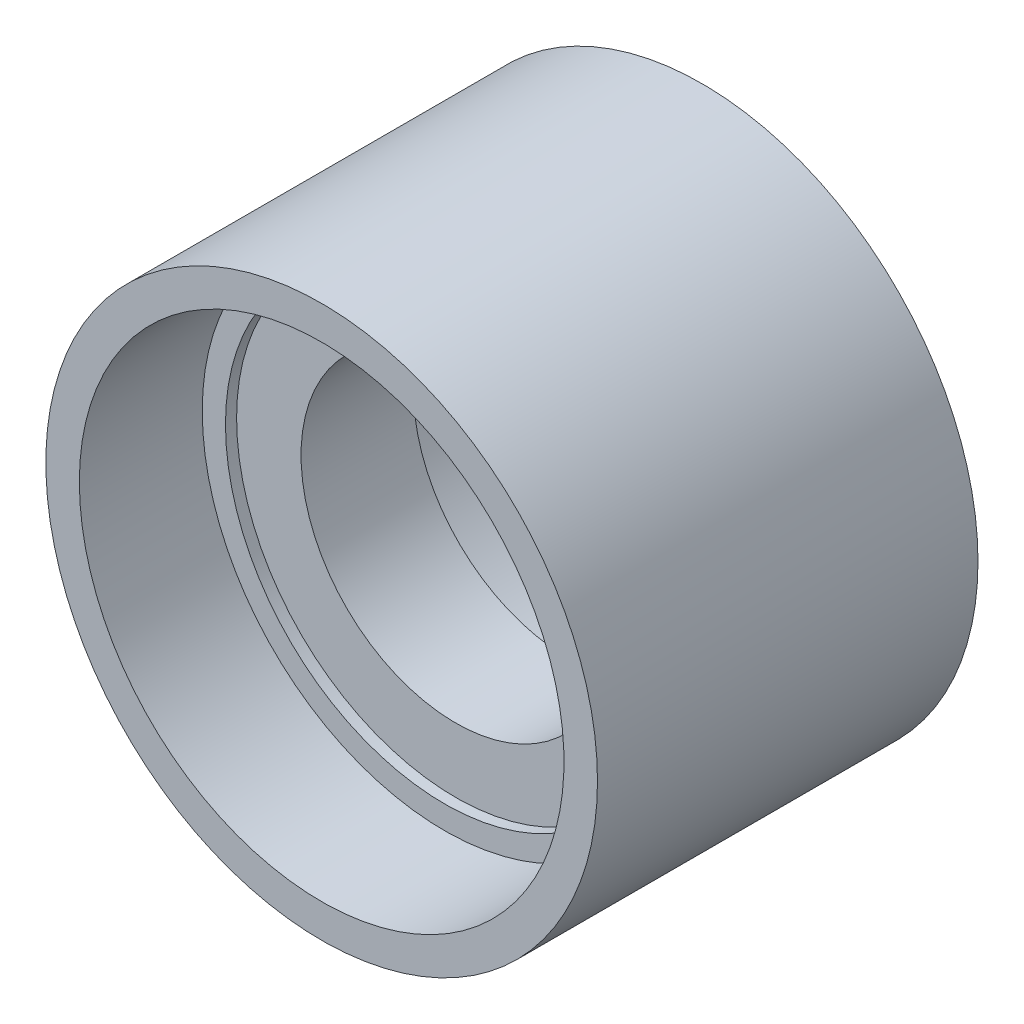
ISO-10303-21;
HEADER;
FILE_DESCRIPTION(('STEP AP214'),'2;1');
FILE_NAME('part.step','',(''),(''),'','','');
FILE_SCHEMA(('AUTOMOTIVE_DESIGN { 1 0 10303 214 1 1 1 1 }'));
ENDSEC;
DATA;
#1=APPLICATION_CONTEXT('core data for automotive mechanical design processes');
#2=APPLICATION_PROTOCOL_DEFINITION('international standard','automotive_design',2000,#1);
#3=PRODUCT_CONTEXT('',#1,'mechanical');
#4=PRODUCT('Part','Part','',(#3));
#5=PRODUCT_RELATED_PRODUCT_CATEGORY('part','',(#4));
#6=PRODUCT_DEFINITION_FORMATION('','',#4);
#7=PRODUCT_DEFINITION_CONTEXT('part definition',#1,'design');
#8=PRODUCT_DEFINITION('design','',#6,#7);
#9=PRODUCT_DEFINITION_SHAPE('','',#8);
#10=(LENGTH_UNIT() NAMED_UNIT(*) SI_UNIT(.MILLI.,.METRE.));
#11=(NAMED_UNIT(*) PLANE_ANGLE_UNIT() SI_UNIT($,.RADIAN.));
#12=(NAMED_UNIT(*) SI_UNIT($,.STERADIAN.) SOLID_ANGLE_UNIT());
#13=UNCERTAINTY_MEASURE_WITH_UNIT(LENGTH_MEASURE(1.E-05),#10,'distance_accuracy_value','');
#14=(GEOMETRIC_REPRESENTATION_CONTEXT(3) GLOBAL_UNCERTAINTY_ASSIGNED_CONTEXT((#13)) GLOBAL_UNIT_ASSIGNED_CONTEXT((#10,
#11,#12)) REPRESENTATION_CONTEXT('',''));
#15=CARTESIAN_POINT('',(0.,0.,0.));
#16=DIRECTION('',(0.,0.,1.));
#17=DIRECTION('',(1.,0.,0.));
#18=AXIS2_PLACEMENT_3D('',#15,#16,#17);
#19=CARTESIAN_POINT('',(0.,0.,0.));
#20=DIRECTION('',(0.,0.,1.));
#21=DIRECTION('',(1.,0.,0.));
#22=AXIS2_PLACEMENT_3D('',#19,#20,#21);
#23=CYLINDRICAL_SURFACE('',#22,15.);
#24=CARTESIAN_POINT('',(0.,0.,5.45));
#25=DIRECTION('',(0.,0.,1.));
#26=DIRECTION('',(1.,0.,0.));
#27=AXIS2_PLACEMENT_3D('',#24,#25,#26);
#28=CIRCLE('',#27,15.);
#29=CARTESIAN_POINT('',(15.,0.,5.45));
#30=VERTEX_POINT('',#29);
#31=EDGE_CURVE('E52',#30,#30,#28,.T.);
#32=ORIENTED_EDGE('',*,*,#31,.T.);
#33=EDGE_LOOP('',(#32));
#34=FACE_BOUND('',#33,.T.);
#35=CARTESIAN_POINT('',(0.,0.,-5.45));
#36=DIRECTION('',(0.,0.,1.));
#37=DIRECTION('',(1.,0.,0.));
#38=AXIS2_PLACEMENT_3D('',#35,#36,#37);
#39=CIRCLE('',#38,15.);
#40=CARTESIAN_POINT('',(15.,0.,-5.45));
#41=VERTEX_POINT('',#40);
#42=EDGE_CURVE('E18',#41,#41,#39,.F.);
#43=ORIENTED_EDGE('',*,*,#42,.T.);
#44=EDGE_LOOP('',(#43));
#45=FACE_BOUND('',#44,.T.);
#46=ADVANCED_FACE('F14',(#34,#45),#23,.F.);
#47=CARTESIAN_POINT('',(21.675,21.675,-5.45));
#48=DIRECTION('',(0.,0.,1.));
#49=DIRECTION('',(-1.,0.,0.));
#50=AXIS2_PLACEMENT_3D('',#47,#48,#49);
#51=PLANE('',#50);
#52=ORIENTED_EDGE('',*,*,#42,.F.);
#53=EDGE_LOOP('',(#52));
#54=FACE_BOUND('',#53,.T.);
#55=CARTESIAN_POINT('',(0.,0.,-5.45));
#56=DIRECTION('',(0.,0.,1.));
#57=DIRECTION('',(0.,-1.,0.));
#58=AXIS2_PLACEMENT_3D('',#55,#56,#57);
#59=CIRCLE('',#58,21.25);
#60=CARTESIAN_POINT('',(0.,-21.25,-5.45));
#61=VERTEX_POINT('',#60);
#62=EDGE_CURVE('E50',#61,#61,#59,.F.);
#63=ORIENTED_EDGE('',*,*,#62,.T.);
#64=EDGE_LOOP('',(#63));
#65=FACE_BOUND('',#64,.T.);
#66=ADVANCED_FACE('F60',(#54,#65),#51,.F.);
#67=CARTESIAN_POINT('',(0.,0.,5.45));
#68=DIRECTION('',(0.,0.,-1.));
#69=DIRECTION('',(-1.,0.,0.));
#70=AXIS2_PLACEMENT_3D('',#67,#68,#69);
#71=PLANE('',#70);
#72=ORIENTED_EDGE('',*,*,#31,.F.);
#73=EDGE_LOOP('',(#72));
#74=FACE_BOUND('',#73,.T.);
#75=CARTESIAN_POINT('',(0.,0.,5.45));
#76=DIRECTION('',(0.,0.,-1.));
#77=DIRECTION('',(-1.,0.,0.));
#78=AXIS2_PLACEMENT_3D('',#75,#76,#77);
#79=CIRCLE('',#78,21.25);
#80=CARTESIAN_POINT('',(-21.25,0.,5.45));
#81=VERTEX_POINT('',#80);
#82=EDGE_CURVE('E47',#81,#81,#79,.F.);
#83=ORIENTED_EDGE('',*,*,#82,.T.);
#84=EDGE_LOOP('',(#83));
#85=FACE_BOUND('',#84,.T.);
#86=ADVANCED_FACE('F63',(#74,#85),#71,.F.);
#87=CARTESIAN_POINT('',(0.,0.,-6.53));
#88=DIRECTION('',(0.,0.,1.));
#89=DIRECTION('',(0.,-1.,0.));
#90=AXIS2_PLACEMENT_3D('',#87,#88,#89);
#91=CYLINDRICAL_SURFACE('',#90,21.25);
#92=CARTESIAN_POINT('',(0.,0.,-6.53));
#93=DIRECTION('',(0.,0.,1.));
#94=DIRECTION('',(0.,-1.,0.));
#95=AXIS2_PLACEMENT_3D('',#92,#93,#94);
#96=CIRCLE('',#95,21.25);
#97=CARTESIAN_POINT('',(0.,-21.25,-6.53));
#98=VERTEX_POINT('',#97);
#99=EDGE_CURVE('E44',#98,#98,#96,.F.);
#100=ORIENTED_EDGE('',*,*,#99,.T.);
#101=EDGE_LOOP('',(#100));
#102=FACE_BOUND('',#101,.T.);
#103=ORIENTED_EDGE('',*,*,#62,.F.);
#104=EDGE_LOOP('',(#103));
#105=FACE_BOUND('',#104,.T.);
#106=ADVANCED_FACE('F67',(#102,#105),#91,.F.);
#107=CARTESIAN_POINT('',(0.,0.,18.45));
#108=DIRECTION('',(0.,0.,-1.));
#109=DIRECTION('',(-1.,0.,0.));
#110=AXIS2_PLACEMENT_3D('',#107,#108,#109);
#111=CYLINDRICAL_SURFACE('',#110,21.25);
#112=ORIENTED_EDGE('',*,*,#82,.F.);
#113=EDGE_LOOP('',(#112));
#114=FACE_BOUND('',#113,.T.);
#115=CARTESIAN_POINT('',(0.,0.,6.53));
#116=DIRECTION('',(0.,0.,-1.));
#117=DIRECTION('',(-1.,0.,0.));
#118=AXIS2_PLACEMENT_3D('',#115,#116,#117);
#119=CIRCLE('',#118,21.25);
#120=CARTESIAN_POINT('',(-21.25,0.,6.53));
#121=VERTEX_POINT('',#120);
#122=EDGE_CURVE('E41',#121,#121,#119,.F.);
#123=ORIENTED_EDGE('',*,*,#122,.T.);
#124=EDGE_LOOP('',(#123));
#125=FACE_BOUND('',#124,.T.);
#126=ADVANCED_FACE('F69',(#114,#125),#111,.F.);
#127=CARTESIAN_POINT('',(23.97,23.97,-6.53));
#128=DIRECTION('',(0.,0.,1.));
#129=DIRECTION('',(-1.,0.,0.));
#130=AXIS2_PLACEMENT_3D('',#127,#128,#129);
#131=PLANE('',#130);
#132=ORIENTED_EDGE('',*,*,#99,.F.);
#133=EDGE_LOOP('',(#132));
#134=FACE_BOUND('',#133,.T.);
#135=CARTESIAN_POINT('',(0.,0.,-6.53));
#136=DIRECTION('',(0.,0.,1.));
#137=DIRECTION('',(0.,-1.,0.));
#138=AXIS2_PLACEMENT_3D('',#135,#136,#137);
#139=CIRCLE('',#138,23.5);
#140=CARTESIAN_POINT('',(0.,-23.5,-6.53));
#141=VERTEX_POINT('',#140);
#142=EDGE_CURVE('E38',#141,#141,#139,.F.);
#143=ORIENTED_EDGE('',*,*,#142,.T.);
#144=EDGE_LOOP('',(#143));
#145=FACE_BOUND('',#144,.T.);
#146=ADVANCED_FACE('F77',(#134,#145),#131,.F.);
#147=CARTESIAN_POINT('',(0.,0.,6.53));
#148=DIRECTION('',(0.,0.,-1.));
#149=DIRECTION('',(-1.,0.,0.));
#150=AXIS2_PLACEMENT_3D('',#147,#148,#149);
#151=PLANE('',#150);
#152=ORIENTED_EDGE('',*,*,#122,.F.);
#153=EDGE_LOOP('',(#152));
#154=FACE_BOUND('',#153,.T.);
#155=CARTESIAN_POINT('',(0.,0.,6.53));
#156=DIRECTION('',(0.,0.,-1.));
#157=DIRECTION('',(-1.,0.,0.));
#158=AXIS2_PLACEMENT_3D('',#155,#156,#157);
#159=CIRCLE('',#158,23.5);
#160=CARTESIAN_POINT('',(-23.5,0.,6.53));
#161=VERTEX_POINT('',#160);
#162=EDGE_CURVE('E35',#161,#161,#159,.F.);
#163=ORIENTED_EDGE('',*,*,#162,.T.);
#164=EDGE_LOOP('',(#163));
#165=FACE_BOUND('',#164,.T.);
#166=ADVANCED_FACE('F101',(#154,#165),#151,.F.);
#167=CARTESIAN_POINT('',(0.,0.,-18.45));
#168=DIRECTION('',(0.,0.,1.));
#169=DIRECTION('',(0.,-1.,0.));
#170=AXIS2_PLACEMENT_3D('',#167,#168,#169);
#171=CYLINDRICAL_SURFACE('',#170,23.5);
#172=CARTESIAN_POINT('',(0.,0.,-18.45));
#173=DIRECTION('',(0.,0.,1.));
#174=DIRECTION('',(0.,-1.,0.));
#175=AXIS2_PLACEMENT_3D('',#172,#173,#174);
#176=CIRCLE('',#175,23.5);
#177=CARTESIAN_POINT('',(0.,-23.5,-18.45));
#178=VERTEX_POINT('',#177);
#179=EDGE_CURVE('E32',#178,#178,#176,.T.);
#180=ORIENTED_EDGE('',*,*,#179,.F.);
#181=EDGE_LOOP('',(#180));
#182=FACE_BOUND('',#181,.T.);
#183=ORIENTED_EDGE('',*,*,#142,.F.);
#184=EDGE_LOOP('',(#183));
#185=FACE_BOUND('',#184,.T.);
#186=ADVANCED_FACE('F16',(#182,#185),#171,.F.);
#187=CARTESIAN_POINT('',(0.,0.,18.45));
#188=DIRECTION('',(0.,0.,-1.));
#189=DIRECTION('',(-1.,0.,0.));
#190=AXIS2_PLACEMENT_3D('',#187,#188,#189);
#191=CYLINDRICAL_SURFACE('',#190,23.5);
#192=CARTESIAN_POINT('',(0.,0.,18.45));
#193=DIRECTION('',(0.,0.,-1.));
#194=DIRECTION('',(-1.,0.,0.));
#195=AXIS2_PLACEMENT_3D('',#192,#193,#194);
#196=CIRCLE('',#195,23.5);
#197=CARTESIAN_POINT('',(-23.5,0.,18.45));
#198=VERTEX_POINT('',#197);
#199=EDGE_CURVE('E27',#198,#198,#196,.F.);
#200=ORIENTED_EDGE('',*,*,#199,.T.);
#201=EDGE_LOOP('',(#200));
#202=FACE_BOUND('',#201,.T.);
#203=ORIENTED_EDGE('',*,*,#162,.F.);
#204=EDGE_LOOP('',(#203));
#205=FACE_BOUND('',#204,.T.);
#206=ADVANCED_FACE('F96',(#202,#205),#191,.F.);
#207=CARTESIAN_POINT('',(0.,0.,-18.45));
#208=DIRECTION('',(0.,0.,-1.));
#209=DIRECTION('',(-1.,0.,0.));
#210=AXIS2_PLACEMENT_3D('',#207,#208,#209);
#211=PLANE('',#210);
#212=ORIENTED_EDGE('',*,*,#179,.T.);
#213=EDGE_LOOP('',(#212));
#214=FACE_BOUND('',#213,.T.);
#215=CARTESIAN_POINT('',(0.,0.,-18.45));
#216=DIRECTION('',(0.,0.,1.));
#217=DIRECTION('',(1.,0.,0.));
#218=AXIS2_PLACEMENT_3D('',#215,#216,#217);
#219=CIRCLE('',#218,26.75);
#220=CARTESIAN_POINT('',(26.75,0.,-18.45));
#221=VERTEX_POINT('',#220);
#222=EDGE_CURVE('E22',#221,#221,#219,.T.);
#223=ORIENTED_EDGE('',*,*,#222,.F.);
#224=EDGE_LOOP('',(#223));
#225=FACE_BOUND('',#224,.T.);
#226=ADVANCED_FACE('F89',(#214,#225),#211,.T.);
#227=CARTESIAN_POINT('',(0.,0.,18.45));
#228=DIRECTION('',(0.,0.,-1.));
#229=DIRECTION('',(-1.,0.,0.));
#230=AXIS2_PLACEMENT_3D('',#227,#228,#229);
#231=PLANE('',#230);
#232=ORIENTED_EDGE('',*,*,#199,.F.);
#233=EDGE_LOOP('',(#232));
#234=FACE_BOUND('',#233,.T.);
#235=CARTESIAN_POINT('',(0.,0.,18.45));
#236=DIRECTION('',(0.,0.,1.));
#237=DIRECTION('',(1.,0.,0.));
#238=AXIS2_PLACEMENT_3D('',#235,#236,#237);
#239=CIRCLE('',#238,26.75);
#240=CARTESIAN_POINT('',(26.75,0.,18.45));
#241=VERTEX_POINT('',#240);
#242=EDGE_CURVE('E10',#241,#241,#239,.F.);
#243=ORIENTED_EDGE('',*,*,#242,.F.);
#244=EDGE_LOOP('',(#243));
#245=FACE_BOUND('',#244,.T.);
#246=ADVANCED_FACE('F84',(#234,#245),#231,.F.);
#247=CARTESIAN_POINT('',(0.,0.,0.));
#248=DIRECTION('',(0.,0.,1.));
#249=DIRECTION('',(1.,0.,0.));
#250=AXIS2_PLACEMENT_3D('',#247,#248,#249);
#251=CYLINDRICAL_SURFACE('',#250,26.75);
#252=ORIENTED_EDGE('',*,*,#242,.T.);
#253=EDGE_LOOP('',(#252));
#254=FACE_BOUND('',#253,.T.);
#255=ORIENTED_EDGE('',*,*,#222,.T.);
#256=EDGE_LOOP('',(#255));
#257=FACE_BOUND('',#256,.T.);
#258=ADVANCED_FACE('F82',(#254,#257),#251,.T.);
#259=CLOSED_SHELL('',(#46,#66,#86,#106,#126,#146,#166,#186,#206,#226,#246,#258));
#260=MANIFOLD_SOLID_BREP('B1',#259);
#261=ADVANCED_BREP_SHAPE_REPRESENTATION('',(#18,#260),#14);
#262=SHAPE_DEFINITION_REPRESENTATION(#9,#261);
ENDSEC;
END-ISO-10303-21;
